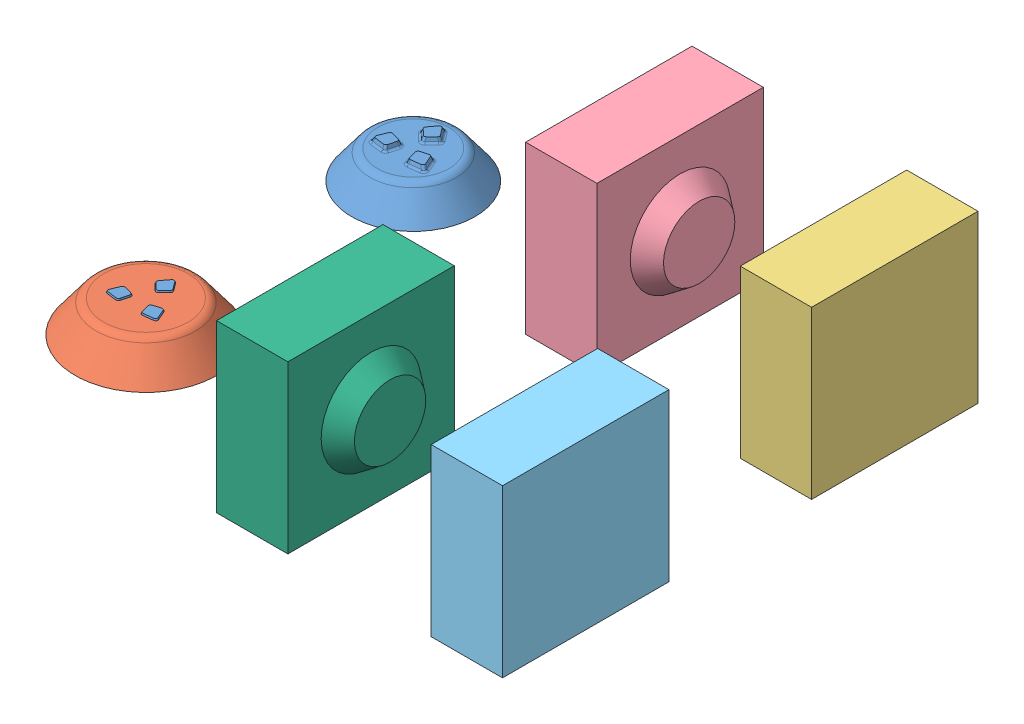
SolidWorks assembly TwoShot.SLDASM, configuration Default (file format 11000). Lengths in mm.
Overall size (114.88 35 100).
7 component instances, 6 part files, 15 mates.
Components (placement in the parent):
- OneShot-1: OneShot.SLDPRT [Default] at origin size (26 7 26)
- ShotTwo-1: ShotTwo.SLDPRT [Default] at origin size (29.75 6.7 29.75)
- OneShot-2: OneShot.SLDPRT [Default] at (0.1137 0 -56.1228) size (26 7 26)
- Cavity1-1: Cavity1.SLDPRT [Default] at (85 17.5 -57.5) x (0 -1 0) z (0 0 1) size (35 15 35)
- Core1-1: Core1.SLDPRT [Default] at (54.8578 17.5 -57.5) x (0 -1 0) z (0 0 1) size (35 19 35)
- Cavity2-1: Cavity2.SLDPRT [Default] at (85 17.5 7.5) x (0 -1 0) z (0 0 1) size (35 15 35)
- Core2-1: Core2.SLDPRT [Default] at (54.8578 17.5 7.5) x (0 -1 0) z (0 0 1) size (35 19 35)
Mates (geometry in assembly coordinates):
- Concentric1: concentric: circle of OneShot-1; circle of ShotTwo-1
- Coincident1: coincident: plane of OneShot-1 through (0 0 -10.5) normal (0 -1 0); plane of ShotTwo-1 through (0 0 -13) normal (0 -1 0)
- Coincident2: coincident: plane of OneShot-1 through (0 6 -6.8) normal (-0.750288 0.34202 -0.565765); plane of ShotTwo-1 through (0 6 -6.8) normal (0.750288 -0.34202 0.565765)
- Coincident4: coincident: plane of OneShot-2 through (0.1137 0 -66.6228) normal (0 -1 0); plane of assembly through (0 0 0) normal (0 1 0)
- Coincident8: coincident: plane of Cavity1-1 through (100 35 -40) normal (0 1 0); plane of Core1-1 through (39.8578 35 -75) normal (0 1 0)
- Coincident5: coincident: plane of Cavity1-1 through (100 35 -75) normal (0 0 -1); plane of Core1-1 through (39.8578 35 -75) normal (0 0 -1)
- Coincident6: coincident: plane of Cavity2-1 through (100 35 -10) normal (0 0 -1); plane of Core2-1 through (39.8578 35 -10) normal (0 0 -1)
- Coincident7: coincident: plane of Cavity2-1 through (100 35 25) normal (0 1 0); plane of Core2-1 through (39.8578 35 -10) normal (0 1 0)
- Coincident9: coincident: plane of Core1-1 through (39.8578 0 -75) normal (0 -1 0); plane of assembly through (0 0 0) normal (0 1 0)
- Coincident10: coincident: plane of Core2-1 through (39.8578 0 -10) normal (0 -1 0); plane of assembly through (0 0 0) normal (0 1 0)
- Coincident11: coincident: plane of Core1-1 through (39.8578 17.5 -57.5) normal (-1 0 0); plane of Core2-1 through (39.8578 17.5 7.5) normal (-1 0 0)
- Distance1: distance = 100 mm: plane of Cavity1-1 through (100 17.5 -57.5) normal (1 0 0); plane of assembly through (0 0 0) normal (1 0 0)
- Coincident13: coincident: plane of Cavity1-1 through (100 17.5 -57.5) normal (1 0 0); plane of Cavity2-1 through (100 17.5 7.5) normal (1 0 0)
- Distance2: distance = 10 mm: plane of Cavity2-1 through (100 35 -10) normal (0 0 -1); plane of assembly through (0 0 0) normal (0 0 1)
- Distance3: distance = 40 mm: plane of Cavity1-1 through (100 35 -40) normal (0 0 1); plane of assembly through (0 0 0) normal (0 0 1)
